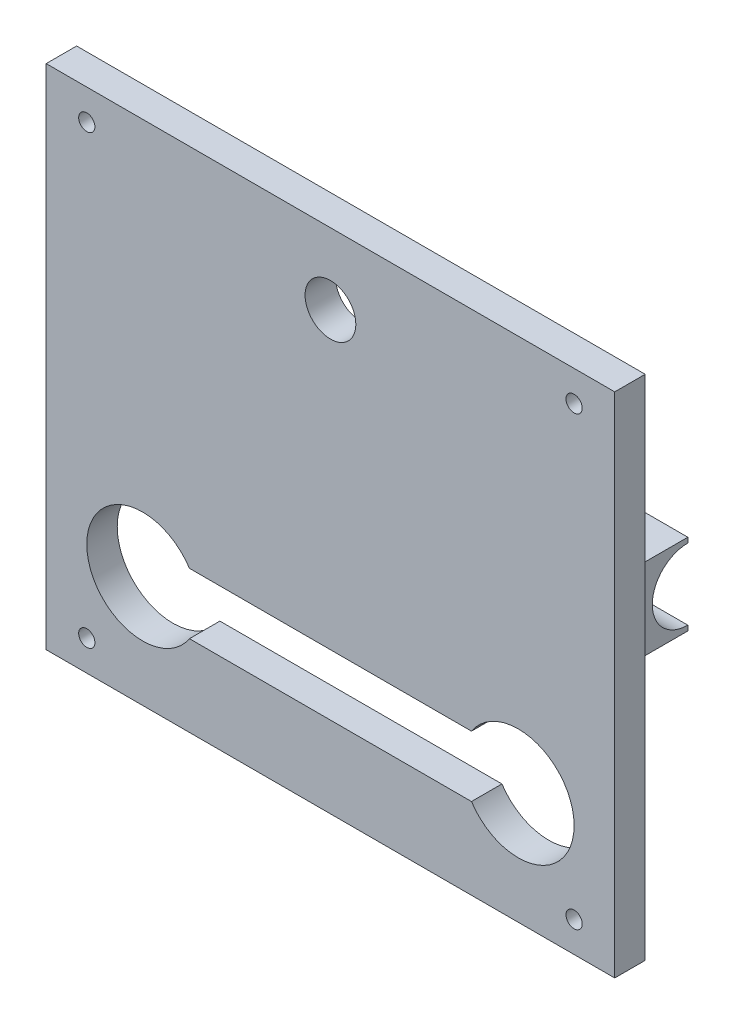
from build123d import *

# Parameters (mm, degrees)
ESQUISSE1_W             = 280
ESQUISSE1_H             = 250
BOSS_EXTRU_1_DEPTH      = 15
ENL_V_MAT_EXTRU_1_DEPTH = 15
ESQUISSE3_W             = 230
ESQUISSE3_H             = 40
BOSS_EXTRU_2_DEPTH      = 46
ESQUISSE4_R             = 12.5
ENL_V_MAT_EXTRU_2_DEPTH = 15
ESQUISSE5_R             = 4
ENL_V_MAT_EXTRU_3_DEPTH = 15
ENL_V_MAT_EXTRU_4_DEPTH = 361.056939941


with BuildPart() as part:
    # Esquisse1 → Boss.-Extru.1 (new body)
    with BuildSketch(Plane.XY):
        with Locations((140, -125)):
            Rectangle(ESQUISSE1_W, ESQUISSE1_H)
    extrude(amount=BOSS_EXTRU_1_DEPTH)

    # Esquisse2 → Enl_v. mat.-Extru.1 (cut)
    with BuildSketch(Plane.XY.offset(15)):
        with BuildLine():
            Line((70.548861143, -180), (209.451138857, -180))
            ThreePointArc((209.451138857, -180), (260, -195), (209.451138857, -210))
            Line((209.451138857, -210), (70.548861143, -210))
            ThreePointArc((70.548861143, -210), (20, -195), (70.548861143, -180))
        make_face()
    extrude(amount=-ENL_V_MAT_EXTRU_1_DEPTH, mode=Mode.SUBTRACT)

    # Esquisse3 → Boss.-Extru.2 (add)
    with BuildSketch(Plane(origin=(0, 0, 0), x_dir=(-1, 0, 0), z_dir=(0, 0, -1))):
        with Locations((-140, -125)):
            Rectangle(ESQUISSE3_W, ESQUISSE3_H)
    extrude(amount=BOSS_EXTRU_2_DEPTH)

    # Esquisse4 → Enl_v. mat.-Extru.2 (cut)
    with BuildSketch(Plane.XY.offset(15)):
        with Locations((140, -35)):
            Circle(ESQUISSE4_R)
    extrude(amount=-ENL_V_MAT_EXTRU_2_DEPTH, mode=Mode.SUBTRACT)

    # Esquisse5 → Enl_v. mat.-Extru.3 (cut)
    with BuildSketch(Plane.XY.offset(15)):
        with Locations((20, -235)):
            Circle(ESQUISSE5_R)
        with Locations((260, -235)):
            Circle(ESQUISSE5_R)
        with Locations((20, -15)):
            Circle(ESQUISSE5_R)
        with Locations((260, -15)):
            Circle(ESQUISSE5_R)
    extrude(amount=-ENL_V_MAT_EXTRU_3_DEPTH, mode=Mode.SUBTRACT)

    # Esquisse6 → Enl_v. mat.-Extru.4 (cut, through all)
    with BuildSketch(Plane(origin=(255, 0, 0), x_dir=(0, 0, -1), z_dir=(1, 0, 0))):
        with BuildLine():
            Line((46, -142.5), (46, -107.5))
            ThreePointArc((46, -107.5), (28.5, -125), (46, -142.5))
        make_face()
    extrude(amount=-ENL_V_MAT_EXTRU_4_DEPTH, mode=Mode.SUBTRACT)


solid = part.part
